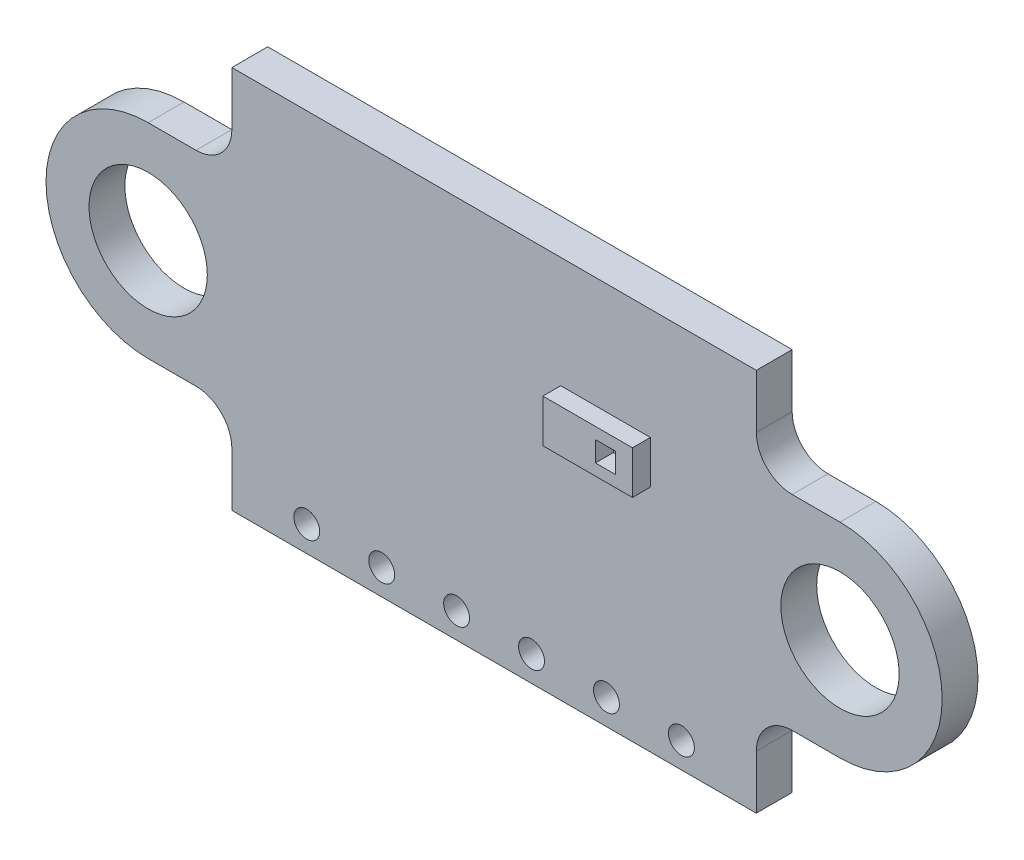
ISO-10303-21;
HEADER;
FILE_DESCRIPTION(('STEP AP214'),'2;1');
FILE_NAME('part.step','',(''),(''),'','','');
FILE_SCHEMA(('AUTOMOTIVE_DESIGN { 1 0 10303 214 1 1 1 1 }'));
ENDSEC;
DATA;
#1=APPLICATION_CONTEXT('core data for automotive mechanical design processes');
#2=APPLICATION_PROTOCOL_DEFINITION('international standard','automotive_design',2000,#1);
#3=PRODUCT_CONTEXT('',#1,'mechanical');
#4=PRODUCT('Part','Part','',(#3));
#5=PRODUCT_RELATED_PRODUCT_CATEGORY('part','',(#4));
#6=PRODUCT_DEFINITION_FORMATION('','',#4);
#7=PRODUCT_DEFINITION_CONTEXT('part definition',#1,'design');
#8=PRODUCT_DEFINITION('design','',#6,#7);
#9=PRODUCT_DEFINITION_SHAPE('','',#8);
#10=(LENGTH_UNIT() NAMED_UNIT(*) SI_UNIT(.MILLI.,.METRE.));
#11=(NAMED_UNIT(*) PLANE_ANGLE_UNIT() SI_UNIT($,.RADIAN.));
#12=(NAMED_UNIT(*) SI_UNIT($,.STERADIAN.) SOLID_ANGLE_UNIT());
#13=UNCERTAINTY_MEASURE_WITH_UNIT(LENGTH_MEASURE(1.E-05),#10,'distance_accuracy_value','');
#14=(GEOMETRIC_REPRESENTATION_CONTEXT(3) GLOBAL_UNCERTAINTY_ASSIGNED_CONTEXT((#13)) GLOBAL_UNIT_ASSIGNED_CONTEXT((#10,
#11,#12)) REPRESENTATION_CONTEXT('',''));
#15=CARTESIAN_POINT('',(0.,0.,0.));
#16=DIRECTION('',(0.,0.,1.));
#17=DIRECTION('',(1.,0.,0.));
#18=AXIS2_PLACEMENT_3D('',#15,#16,#17);
#19=CARTESIAN_POINT('',(-8.31558773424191,-3.85,0.999999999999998));
#20=DIRECTION('',(0.,0.,-1.));
#21=DIRECTION('',(-1.,0.,0.));
#22=AXIS2_PLACEMENT_3D('',#19,#20,#21);
#23=PLANE('',#22);
#24=DIRECTION('',(0.,1.,0.));
#25=VECTOR('',#24,1.);
#26=CARTESIAN_POINT('',(7.31558773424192,-3.85,0.999999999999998));
#27=LINE('',#26,#25);
#28=CARTESIAN_POINT('',(7.31558773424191,-5.35,0.999999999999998));
#29=VERTEX_POINT('',#28);
#30=CARTESIAN_POINT('',(7.31558773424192,-3.85,0.999999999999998));
#31=VERTEX_POINT('',#30);
#32=EDGE_CURVE('E319',#29,#31,#27,.T.);
#33=ORIENTED_EDGE('',*,*,#32,.T.);
#34=CARTESIAN_POINT('',(8.31558773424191,-3.85,0.999999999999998));
#35=DIRECTION('',(0.,0.,-1.));
#36=DIRECTION('',(1.,0.,0.));
#37=AXIS2_PLACEMENT_3D('',#34,#35,#36);
#38=CIRCLE('',#37,1.);
#39=CARTESIAN_POINT('',(8.31558773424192,-2.85,0.999999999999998));
#40=VERTEX_POINT('',#39);
#41=EDGE_CURVE('E322',#31,#40,#38,.T.);
#42=ORIENTED_EDGE('',*,*,#41,.T.);
#43=DIRECTION('',(1.,0.,0.));
#44=VECTOR('',#43,1.);
#45=CARTESIAN_POINT('',(9.65,-2.85,0.999999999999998));
#46=LINE('',#45,#44);
#47=CARTESIAN_POINT('',(9.65,-2.85,0.999999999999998));
#48=VERTEX_POINT('',#47);
#49=EDGE_CURVE('E325',#40,#48,#46,.T.);
#50=ORIENTED_EDGE('',*,*,#49,.T.);
#51=CARTESIAN_POINT('',(9.65,0.,0.999999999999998));
#52=DIRECTION('',(0.,0.,1.));
#53=DIRECTION('',(-1.,0.,0.));
#54=AXIS2_PLACEMENT_3D('',#51,#52,#53);
#55=CIRCLE('',#54,2.85);
#56=CARTESIAN_POINT('',(9.65,2.85,0.999999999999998));
#57=VERTEX_POINT('',#56);
#58=EDGE_CURVE('E327',#48,#57,#55,.T.);
#59=ORIENTED_EDGE('',*,*,#58,.T.);
#60=DIRECTION('',(-1.,0.,0.));
#61=VECTOR('',#60,1.);
#62=CARTESIAN_POINT('',(9.65,2.85,0.999999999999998));
#63=LINE('',#62,#61);
#64=CARTESIAN_POINT('',(8.31558773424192,2.85,0.999999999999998));
#65=VERTEX_POINT('',#64);
#66=EDGE_CURVE('E329',#57,#65,#63,.T.);
#67=ORIENTED_EDGE('',*,*,#66,.T.);
#68=CARTESIAN_POINT('',(8.31558773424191,3.85,0.999999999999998));
#69=DIRECTION('',(0.,0.,-1.));
#70=DIRECTION('',(-1.,0.,0.));
#71=AXIS2_PLACEMENT_3D('',#68,#69,#70);
#72=CIRCLE('',#71,0.999999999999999);
#73=CARTESIAN_POINT('',(7.31558773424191,3.85,0.999999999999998));
#74=VERTEX_POINT('',#73);
#75=EDGE_CURVE('E331',#65,#74,#72,.T.);
#76=ORIENTED_EDGE('',*,*,#75,.T.);
#77=DIRECTION('',(0.,1.,0.));
#78=VECTOR('',#77,1.);
#79=CARTESIAN_POINT('',(7.31558773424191,5.35,0.999999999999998));
#80=LINE('',#79,#78);
#81=CARTESIAN_POINT('',(7.31558773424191,5.35,0.999999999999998));
#82=VERTEX_POINT('',#81);
#83=EDGE_CURVE('E333',#74,#82,#80,.T.);
#84=ORIENTED_EDGE('',*,*,#83,.T.);
#85=DIRECTION('',(-1.,0.,0.));
#86=VECTOR('',#85,1.);
#87=CARTESIAN_POINT('',(-7.31558773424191,5.35,0.999999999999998));
#88=LINE('',#87,#86);
#89=CARTESIAN_POINT('',(-7.31558773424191,5.35,0.999999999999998));
#90=VERTEX_POINT('',#89);
#91=EDGE_CURVE('E335',#82,#90,#88,.T.);
#92=ORIENTED_EDGE('',*,*,#91,.T.);
#93=DIRECTION('',(0.,-1.,0.));
#94=VECTOR('',#93,1.);
#95=CARTESIAN_POINT('',(-7.31558773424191,5.35,0.999999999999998));
#96=LINE('',#95,#94);
#97=CARTESIAN_POINT('',(-7.31558773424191,3.84999999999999,0.999999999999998));
#98=VERTEX_POINT('',#97);
#99=EDGE_CURVE('E337',#90,#98,#96,.T.);
#100=ORIENTED_EDGE('',*,*,#99,.T.);
#101=CARTESIAN_POINT('',(-8.31558773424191,3.84999999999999,0.999999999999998));
#102=DIRECTION('',(0.,0.,-1.));
#103=DIRECTION('',(1.,0.,0.));
#104=AXIS2_PLACEMENT_3D('',#101,#102,#103);
#105=CIRCLE('',#104,1.);
#106=CARTESIAN_POINT('',(-8.31558773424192,2.85,0.999999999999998));
#107=VERTEX_POINT('',#106);
#108=EDGE_CURVE('E339',#98,#107,#105,.T.);
#109=ORIENTED_EDGE('',*,*,#108,.T.);
#110=DIRECTION('',(-1.,0.,0.));
#111=VECTOR('',#110,1.);
#112=CARTESIAN_POINT('',(-9.65,2.85,0.999999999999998));
#113=LINE('',#112,#111);
#114=CARTESIAN_POINT('',(-9.65,2.85,0.999999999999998));
#115=VERTEX_POINT('',#114);
#116=EDGE_CURVE('E341',#107,#115,#113,.T.);
#117=ORIENTED_EDGE('',*,*,#116,.T.);
#118=CARTESIAN_POINT('',(-9.65,0.,0.999999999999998));
#119=DIRECTION('',(0.,0.,1.));
#120=DIRECTION('',(1.,0.,0.));
#121=AXIS2_PLACEMENT_3D('',#118,#119,#120);
#122=CIRCLE('',#121,2.85);
#123=CARTESIAN_POINT('',(-9.65,-2.85,0.999999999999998));
#124=VERTEX_POINT('',#123);
#125=EDGE_CURVE('E343',#115,#124,#122,.T.);
#126=ORIENTED_EDGE('',*,*,#125,.T.);
#127=DIRECTION('',(1.,0.,0.));
#128=VECTOR('',#127,1.);
#129=CARTESIAN_POINT('',(-9.65,-2.85,0.999999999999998));
#130=LINE('',#129,#128);
#131=CARTESIAN_POINT('',(-8.31558773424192,-2.85,0.999999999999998));
#132=VERTEX_POINT('',#131);
#133=EDGE_CURVE('E345',#124,#132,#130,.T.);
#134=ORIENTED_EDGE('',*,*,#133,.T.);
#135=CARTESIAN_POINT('',(-8.31558773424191,-3.85,0.999999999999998));
#136=DIRECTION('',(0.,0.,-1.));
#137=DIRECTION('',(-1.,0.,0.));
#138=AXIS2_PLACEMENT_3D('',#135,#136,#137);
#139=CIRCLE('',#138,1.);
#140=CARTESIAN_POINT('',(-7.31558773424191,-3.85000000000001,0.999999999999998));
#141=VERTEX_POINT('',#140);
#142=EDGE_CURVE('E347',#132,#141,#139,.T.);
#143=ORIENTED_EDGE('',*,*,#142,.T.);
#144=DIRECTION('',(0.,-1.,0.));
#145=VECTOR('',#144,1.);
#146=CARTESIAN_POINT('',(-7.31558773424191,-3.85000000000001,0.999999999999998));
#147=LINE('',#146,#145);
#148=CARTESIAN_POINT('',(-7.31558773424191,-5.35,0.999999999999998));
#149=VERTEX_POINT('',#148);
#150=EDGE_CURVE('E349',#141,#149,#147,.T.);
#151=ORIENTED_EDGE('',*,*,#150,.T.);
#152=DIRECTION('',(1.,0.,0.));
#153=VECTOR('',#152,1.);
#154=CARTESIAN_POINT('',(-7.31558773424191,-5.35,0.999999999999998));
#155=LINE('',#154,#153);
#156=EDGE_CURVE('E351',#149,#29,#155,.T.);
#157=ORIENTED_EDGE('',*,*,#156,.T.);
#158=EDGE_LOOP('',(#33,#42,#50,#59,#67,#76,#84,#92,#100,#109,#117,#126,#134,#143,#151,#157));
#159=FACE_BOUND('',#158,.T.);
#160=CARTESIAN_POINT('',(-9.65,0.,0.999999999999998));
#161=DIRECTION('',(0.,0.,1.));
#162=DIRECTION('',(1.,0.,0.));
#163=AXIS2_PLACEMENT_3D('',#160,#161,#162);
#164=CIRCLE('',#163,1.65);
#165=CARTESIAN_POINT('',(-8.,0.,0.999999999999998));
#166=VERTEX_POINT('',#165);
#167=EDGE_CURVE('E313',#166,#166,#164,.T.);
#168=ORIENTED_EDGE('',*,*,#167,.F.);
#169=EDGE_LOOP('',(#168));
#170=FACE_BOUND('',#169,.T.);
#171=CARTESIAN_POINT('',(9.65,0.,0.999999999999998));
#172=DIRECTION('',(0.,0.,1.));
#173=DIRECTION('',(-1.,0.,0.));
#174=AXIS2_PLACEMENT_3D('',#171,#172,#173);
#175=CIRCLE('',#174,1.65);
#176=CARTESIAN_POINT('',(8.,0.,0.999999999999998));
#177=VERTEX_POINT('',#176);
#178=EDGE_CURVE('E307',#177,#177,#175,.T.);
#179=ORIENTED_EDGE('',*,*,#178,.F.);
#180=EDGE_LOOP('',(#179));
#181=FACE_BOUND('',#180,.T.);
#182=CARTESIAN_POINT('',(-5.22541981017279,-4.63777756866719,0.999999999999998));
#183=DIRECTION('',(0.,0.,1.));
#184=DIRECTION('',(1.,0.,0.));
#185=AXIS2_PLACEMENT_3D('',#182,#183,#184);
#186=CIRCLE('',#185,0.3614638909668);
#187=CARTESIAN_POINT('',(-4.86395591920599,-4.63777756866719,0.999999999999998));
#188=VERTEX_POINT('',#187);
#189=EDGE_CURVE('E301',#188,#188,#186,.T.);
#190=ORIENTED_EDGE('',*,*,#189,.F.);
#191=EDGE_LOOP('',(#190));
#192=FACE_BOUND('',#191,.T.);
#193=CARTESIAN_POINT('',(-3.13525188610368,-4.63777756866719,0.999999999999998));
#194=DIRECTION('',(0.,0.,1.));
#195=DIRECTION('',(1.,0.,0.));
#196=AXIS2_PLACEMENT_3D('',#193,#194,#195);
#197=CIRCLE('',#196,0.3614638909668);
#198=CARTESIAN_POINT('',(-2.77378799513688,-4.63777756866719,0.999999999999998));
#199=VERTEX_POINT('',#198);
#200=EDGE_CURVE('E295',#199,#199,#197,.T.);
#201=ORIENTED_EDGE('',*,*,#200,.F.);
#202=EDGE_LOOP('',(#201));
#203=FACE_BOUND('',#202,.T.);
#204=CARTESIAN_POINT('',(-1.04508396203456,-4.63777756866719,0.999999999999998));
#205=DIRECTION('',(0.,0.,1.));
#206=DIRECTION('',(1.,0.,0.));
#207=AXIS2_PLACEMENT_3D('',#204,#205,#206);
#208=CIRCLE('',#207,0.3614638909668);
#209=CARTESIAN_POINT('',(-0.683620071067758,-4.63777756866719,0.999999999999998));
#210=VERTEX_POINT('',#209);
#211=EDGE_CURVE('E289',#210,#210,#208,.T.);
#212=ORIENTED_EDGE('',*,*,#211,.F.);
#213=EDGE_LOOP('',(#212));
#214=FACE_BOUND('',#213,.T.);
#215=CARTESIAN_POINT('',(1.04508396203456,-4.63777756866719,0.999999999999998));
#216=DIRECTION('',(0.,0.,1.));
#217=DIRECTION('',(-1.,0.,0.));
#218=AXIS2_PLACEMENT_3D('',#215,#216,#217);
#219=CIRCLE('',#218,0.3614638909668);
#220=CARTESIAN_POINT('',(0.68362007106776,-4.63777756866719,0.999999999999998));
#221=VERTEX_POINT('',#220);
#222=EDGE_CURVE('E283',#221,#221,#219,.T.);
#223=ORIENTED_EDGE('',*,*,#222,.F.);
#224=EDGE_LOOP('',(#223));
#225=FACE_BOUND('',#224,.T.);
#226=CARTESIAN_POINT('',(3.13525188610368,-4.63777756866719,0.999999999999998));
#227=DIRECTION('',(0.,0.,1.));
#228=DIRECTION('',(-1.,0.,0.));
#229=AXIS2_PLACEMENT_3D('',#226,#227,#228);
#230=CIRCLE('',#229,0.3614638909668);
#231=CARTESIAN_POINT('',(2.77378799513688,-4.63777756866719,0.999999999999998));
#232=VERTEX_POINT('',#231);
#233=EDGE_CURVE('E277',#232,#232,#230,.T.);
#234=ORIENTED_EDGE('',*,*,#233,.F.);
#235=EDGE_LOOP('',(#234));
#236=FACE_BOUND('',#235,.T.);
#237=CARTESIAN_POINT('',(5.2254198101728,-4.63777756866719,0.999999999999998));
#238=DIRECTION('',(0.,0.,1.));
#239=DIRECTION('',(-1.,0.,0.));
#240=AXIS2_PLACEMENT_3D('',#237,#238,#239);
#241=CIRCLE('',#240,0.3614638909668);
#242=CARTESIAN_POINT('',(4.863955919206,-4.63777756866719,0.999999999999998));
#243=VERTEX_POINT('',#242);
#244=EDGE_CURVE('E271',#243,#243,#241,.T.);
#245=ORIENTED_EDGE('',*,*,#244,.F.);
#246=EDGE_LOOP('',(#245));
#247=FACE_BOUND('',#246,.T.);
#248=DIRECTION('',(0.,1.,0.));
#249=VECTOR('',#248,1.);
#250=CARTESIAN_POINT('',(4.36,2.25023521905,0.999999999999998));
#251=LINE('',#250,#249);
#252=CARTESIAN_POINT('',(4.36,1.04976478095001,0.999999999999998));
#253=VERTEX_POINT('',#252);
#254=CARTESIAN_POINT('',(4.36,2.25023521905,0.999999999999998));
#255=VERTEX_POINT('',#254);
#256=EDGE_CURVE('E219',#253,#255,#251,.T.);
#257=ORIENTED_EDGE('',*,*,#256,.F.);
#258=DIRECTION('',(1.,0.,0.));
#259=VECTOR('',#258,1.);
#260=CARTESIAN_POINT('',(1.86,1.04976478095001,0.999999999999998));
#261=LINE('',#260,#259);
#262=CARTESIAN_POINT('',(1.86,1.04976478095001,0.999999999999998));
#263=VERTEX_POINT('',#262);
#264=EDGE_CURVE('E247',#263,#253,#261,.T.);
#265=ORIENTED_EDGE('',*,*,#264,.F.);
#266=DIRECTION('',(0.,-1.,0.));
#267=VECTOR('',#266,1.);
#268=CARTESIAN_POINT('',(1.86,2.25023521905,0.999999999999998));
#269=LINE('',#268,#267);
#270=CARTESIAN_POINT('',(1.86,2.25023521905,0.999999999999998));
#271=VERTEX_POINT('',#270);
#272=EDGE_CURVE('E61',#271,#263,#269,.T.);
#273=ORIENTED_EDGE('',*,*,#272,.F.);
#274=DIRECTION('',(-1.,0.,0.));
#275=VECTOR('',#274,1.);
#276=CARTESIAN_POINT('',(1.86,2.25023521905,0.999999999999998));
#277=LINE('',#276,#275);
#278=EDGE_CURVE('E56',#255,#271,#277,.T.);
#279=ORIENTED_EDGE('',*,*,#278,.F.);
#280=EDGE_LOOP('',(#257,#265,#273,#279));
#281=FACE_BOUND('',#280,.T.);
#282=ADVANCED_FACE('F41',(#159,#170,#181,#192,#203,#214,#225,#236,#247,#281),#23,.F.);
#283=CARTESIAN_POINT('',(-8.31558773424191,-3.85,0.));
#284=DIRECTION('',(0.,0.,-1.));
#285=DIRECTION('',(-1.,0.,0.));
#286=AXIS2_PLACEMENT_3D('',#283,#284,#285);
#287=PLANE('',#286);
#288=CARTESIAN_POINT('',(3.13525188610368,-4.63777756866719,0.));
#289=DIRECTION('',(0.,0.,1.));
#290=DIRECTION('',(-1.,0.,0.));
#291=AXIS2_PLACEMENT_3D('',#288,#289,#290);
#292=CIRCLE('',#291,0.3614638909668);
#293=CARTESIAN_POINT('',(2.77378799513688,-4.63777756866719,0.));
#294=VERTEX_POINT('',#293);
#295=EDGE_CURVE('E274',#294,#294,#292,.T.);
#296=ORIENTED_EDGE('',*,*,#295,.T.);
#297=EDGE_LOOP('',(#296));
#298=FACE_BOUND('',#297,.T.);
#299=CARTESIAN_POINT('',(-1.04508396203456,-4.63777756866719,0.));
#300=DIRECTION('',(0.,0.,1.));
#301=DIRECTION('',(1.,0.,0.));
#302=AXIS2_PLACEMENT_3D('',#299,#300,#301);
#303=CIRCLE('',#302,0.3614638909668);
#304=CARTESIAN_POINT('',(-0.683620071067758,-4.63777756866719,0.));
#305=VERTEX_POINT('',#304);
#306=EDGE_CURVE('E286',#305,#305,#303,.T.);
#307=ORIENTED_EDGE('',*,*,#306,.T.);
#308=EDGE_LOOP('',(#307));
#309=FACE_BOUND('',#308,.T.);
#310=CARTESIAN_POINT('',(-5.22541981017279,-4.63777756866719,0.));
#311=DIRECTION('',(0.,0.,1.));
#312=DIRECTION('',(1.,0.,0.));
#313=AXIS2_PLACEMENT_3D('',#310,#311,#312);
#314=CIRCLE('',#313,0.3614638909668);
#315=CARTESIAN_POINT('',(-4.86395591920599,-4.63777756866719,0.));
#316=VERTEX_POINT('',#315);
#317=EDGE_CURVE('E298',#316,#316,#314,.T.);
#318=ORIENTED_EDGE('',*,*,#317,.T.);
#319=EDGE_LOOP('',(#318));
#320=FACE_BOUND('',#319,.T.);
#321=CARTESIAN_POINT('',(-9.65,0.,0.));
#322=DIRECTION('',(0.,0.,1.));
#323=DIRECTION('',(1.,0.,0.));
#324=AXIS2_PLACEMENT_3D('',#321,#322,#323);
#325=CIRCLE('',#324,1.65);
#326=CARTESIAN_POINT('',(-8.,0.,0.));
#327=VERTEX_POINT('',#326);
#328=EDGE_CURVE('E310',#327,#327,#325,.T.);
#329=ORIENTED_EDGE('',*,*,#328,.T.);
#330=EDGE_LOOP('',(#329));
#331=FACE_BOUND('',#330,.T.);
#332=DIRECTION('',(0.,1.,0.));
#333=VECTOR('',#332,1.);
#334=CARTESIAN_POINT('',(7.31558773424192,-3.85,0.));
#335=LINE('',#334,#333);
#336=CARTESIAN_POINT('',(7.31558773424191,-5.35,0.));
#337=VERTEX_POINT('',#336);
#338=CARTESIAN_POINT('',(7.31558773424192,-3.85,0.));
#339=VERTEX_POINT('',#338);
#340=EDGE_CURVE('E316',#337,#339,#335,.T.);
#341=ORIENTED_EDGE('',*,*,#340,.F.);
#342=DIRECTION('',(1.,0.,0.));
#343=VECTOR('',#342,1.);
#344=CARTESIAN_POINT('',(-7.31558773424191,-5.35,0.));
#345=LINE('',#344,#343);
#346=CARTESIAN_POINT('',(-7.31558773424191,-5.35,0.));
#347=VERTEX_POINT('',#346);
#348=EDGE_CURVE('E323',#347,#337,#345,.T.);
#349=ORIENTED_EDGE('',*,*,#348,.F.);
#350=DIRECTION('',(0.,-1.,0.));
#351=VECTOR('',#350,1.);
#352=CARTESIAN_POINT('',(-7.31558773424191,-3.85000000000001,0.));
#353=LINE('',#352,#351);
#354=CARTESIAN_POINT('',(-7.31558773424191,-3.85000000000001,0.));
#355=VERTEX_POINT('',#354);
#356=EDGE_CURVE('E382',#355,#347,#353,.T.);
#357=ORIENTED_EDGE('',*,*,#356,.F.);
#358=CARTESIAN_POINT('',(-8.31558773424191,-3.85,0.));
#359=DIRECTION('',(0.,0.,-1.));
#360=DIRECTION('',(-1.,0.,0.));
#361=AXIS2_PLACEMENT_3D('',#358,#359,#360);
#362=CIRCLE('',#361,1.);
#363=CARTESIAN_POINT('',(-8.31558773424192,-2.85,0.));
#364=VERTEX_POINT('',#363);
#365=EDGE_CURVE('E380',#364,#355,#362,.T.);
#366=ORIENTED_EDGE('',*,*,#365,.F.);
#367=DIRECTION('',(1.,0.,0.));
#368=VECTOR('',#367,1.);
#369=CARTESIAN_POINT('',(-9.65,-2.85,0.));
#370=LINE('',#369,#368);
#371=CARTESIAN_POINT('',(-9.65,-2.85,0.));
#372=VERTEX_POINT('',#371);
#373=EDGE_CURVE('E378',#372,#364,#370,.T.);
#374=ORIENTED_EDGE('',*,*,#373,.F.);
#375=CARTESIAN_POINT('',(-9.65,0.,0.));
#376=DIRECTION('',(0.,0.,1.));
#377=DIRECTION('',(1.,0.,0.));
#378=AXIS2_PLACEMENT_3D('',#375,#376,#377);
#379=CIRCLE('',#378,2.85);
#380=CARTESIAN_POINT('',(-9.65,2.85,0.));
#381=VERTEX_POINT('',#380);
#382=EDGE_CURVE('E376',#381,#372,#379,.T.);
#383=ORIENTED_EDGE('',*,*,#382,.F.);
#384=DIRECTION('',(-1.,0.,0.));
#385=VECTOR('',#384,1.);
#386=CARTESIAN_POINT('',(-9.65,2.85,0.));
#387=LINE('',#386,#385);
#388=CARTESIAN_POINT('',(-8.31558773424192,2.85,0.));
#389=VERTEX_POINT('',#388);
#390=EDGE_CURVE('E374',#389,#381,#387,.T.);
#391=ORIENTED_EDGE('',*,*,#390,.F.);
#392=CARTESIAN_POINT('',(-8.31558773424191,3.84999999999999,0.));
#393=DIRECTION('',(0.,0.,-1.));
#394=DIRECTION('',(1.,0.,0.));
#395=AXIS2_PLACEMENT_3D('',#392,#393,#394);
#396=CIRCLE('',#395,1.);
#397=CARTESIAN_POINT('',(-7.31558773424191,3.84999999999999,0.));
#398=VERTEX_POINT('',#397);
#399=EDGE_CURVE('E372',#398,#389,#396,.T.);
#400=ORIENTED_EDGE('',*,*,#399,.F.);
#401=DIRECTION('',(0.,-1.,0.));
#402=VECTOR('',#401,1.);
#403=CARTESIAN_POINT('',(-7.31558773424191,5.35,0.));
#404=LINE('',#403,#402);
#405=CARTESIAN_POINT('',(-7.31558773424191,5.35,0.));
#406=VERTEX_POINT('',#405);
#407=EDGE_CURVE('E370',#406,#398,#404,.T.);
#408=ORIENTED_EDGE('',*,*,#407,.F.);
#409=DIRECTION('',(-1.,0.,0.));
#410=VECTOR('',#409,1.);
#411=CARTESIAN_POINT('',(-7.31558773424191,5.35,0.));
#412=LINE('',#411,#410);
#413=CARTESIAN_POINT('',(7.31558773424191,5.35,0.));
#414=VERTEX_POINT('',#413);
#415=EDGE_CURVE('E368',#414,#406,#412,.T.);
#416=ORIENTED_EDGE('',*,*,#415,.F.);
#417=DIRECTION('',(0.,1.,0.));
#418=VECTOR('',#417,1.);
#419=CARTESIAN_POINT('',(7.31558773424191,5.35,0.));
#420=LINE('',#419,#418);
#421=CARTESIAN_POINT('',(7.31558773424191,3.85,0.));
#422=VERTEX_POINT('',#421);
#423=EDGE_CURVE('E366',#422,#414,#420,.T.);
#424=ORIENTED_EDGE('',*,*,#423,.F.);
#425=CARTESIAN_POINT('',(8.31558773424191,3.85,0.));
#426=DIRECTION('',(0.,0.,-1.));
#427=DIRECTION('',(-1.,0.,0.));
#428=AXIS2_PLACEMENT_3D('',#425,#426,#427);
#429=CIRCLE('',#428,0.999999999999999);
#430=CARTESIAN_POINT('',(8.31558773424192,2.85,0.));
#431=VERTEX_POINT('',#430);
#432=EDGE_CURVE('E364',#431,#422,#429,.T.);
#433=ORIENTED_EDGE('',*,*,#432,.F.);
#434=DIRECTION('',(-1.,0.,0.));
#435=VECTOR('',#434,1.);
#436=CARTESIAN_POINT('',(9.65,2.85,0.));
#437=LINE('',#436,#435);
#438=CARTESIAN_POINT('',(9.65,2.85,0.));
#439=VERTEX_POINT('',#438);
#440=EDGE_CURVE('E362',#439,#431,#437,.T.);
#441=ORIENTED_EDGE('',*,*,#440,.F.);
#442=CARTESIAN_POINT('',(9.65,0.,0.));
#443=DIRECTION('',(0.,0.,1.));
#444=DIRECTION('',(-1.,0.,0.));
#445=AXIS2_PLACEMENT_3D('',#442,#443,#444);
#446=CIRCLE('',#445,2.85);
#447=CARTESIAN_POINT('',(9.65,-2.85,0.));
#448=VERTEX_POINT('',#447);
#449=EDGE_CURVE('E360',#448,#439,#446,.T.);
#450=ORIENTED_EDGE('',*,*,#449,.F.);
#451=DIRECTION('',(1.,0.,0.));
#452=VECTOR('',#451,1.);
#453=CARTESIAN_POINT('',(9.65,-2.85,0.));
#454=LINE('',#453,#452);
#455=CARTESIAN_POINT('',(8.31558773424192,-2.85,0.));
#456=VERTEX_POINT('',#455);
#457=EDGE_CURVE('E358',#456,#448,#454,.T.);
#458=ORIENTED_EDGE('',*,*,#457,.F.);
#459=CARTESIAN_POINT('',(8.31558773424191,-3.85,0.));
#460=DIRECTION('',(0.,0.,-1.));
#461=DIRECTION('',(1.,0.,0.));
#462=AXIS2_PLACEMENT_3D('',#459,#460,#461);
#463=CIRCLE('',#462,1.);
#464=EDGE_CURVE('E356',#339,#456,#463,.T.);
#465=ORIENTED_EDGE('',*,*,#464,.F.);
#466=EDGE_LOOP('',(#341,#349,#357,#366,#374,#383,#391,#400,#408,#416,#424,#433,#441,#450,#458,#465));
#467=FACE_BOUND('',#466,.T.);
#468=CARTESIAN_POINT('',(9.65,0.,0.));
#469=DIRECTION('',(0.,0.,1.));
#470=DIRECTION('',(-1.,0.,0.));
#471=AXIS2_PLACEMENT_3D('',#468,#469,#470);
#472=CIRCLE('',#471,1.65);
#473=CARTESIAN_POINT('',(8.,0.,0.));
#474=VERTEX_POINT('',#473);
#475=EDGE_CURVE('E304',#474,#474,#472,.T.);
#476=ORIENTED_EDGE('',*,*,#475,.T.);
#477=EDGE_LOOP('',(#476));
#478=FACE_BOUND('',#477,.T.);
#479=CARTESIAN_POINT('',(-3.13525188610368,-4.63777756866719,0.));
#480=DIRECTION('',(0.,0.,1.));
#481=DIRECTION('',(1.,0.,0.));
#482=AXIS2_PLACEMENT_3D('',#479,#480,#481);
#483=CIRCLE('',#482,0.3614638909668);
#484=CARTESIAN_POINT('',(-2.77378799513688,-4.63777756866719,0.));
#485=VERTEX_POINT('',#484);
#486=EDGE_CURVE('E292',#485,#485,#483,.T.);
#487=ORIENTED_EDGE('',*,*,#486,.T.);
#488=EDGE_LOOP('',(#487));
#489=FACE_BOUND('',#488,.T.);
#490=CARTESIAN_POINT('',(1.04508396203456,-4.63777756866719,0.));
#491=DIRECTION('',(0.,0.,1.));
#492=DIRECTION('',(-1.,0.,0.));
#493=AXIS2_PLACEMENT_3D('',#490,#491,#492);
#494=CIRCLE('',#493,0.3614638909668);
#495=CARTESIAN_POINT('',(0.68362007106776,-4.63777756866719,0.));
#496=VERTEX_POINT('',#495);
#497=EDGE_CURVE('E280',#496,#496,#494,.T.);
#498=ORIENTED_EDGE('',*,*,#497,.T.);
#499=EDGE_LOOP('',(#498));
#500=FACE_BOUND('',#499,.T.);
#501=CARTESIAN_POINT('',(5.2254198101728,-4.63777756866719,0.));
#502=DIRECTION('',(0.,0.,1.));
#503=DIRECTION('',(-1.,0.,0.));
#504=AXIS2_PLACEMENT_3D('',#501,#502,#503);
#505=CIRCLE('',#504,0.3614638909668);
#506=CARTESIAN_POINT('',(4.863955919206,-4.63777756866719,0.));
#507=VERTEX_POINT('',#506);
#508=EDGE_CURVE('E270',#507,#507,#505,.T.);
#509=ORIENTED_EDGE('',*,*,#508,.T.);
#510=EDGE_LOOP('',(#509));
#511=FACE_BOUND('',#510,.T.);
#512=ADVANCED_FACE('F436',(#298,#309,#320,#331,#467,#478,#489,#500,#511),#287,.T.);
#513=CARTESIAN_POINT('',(7.31558773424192,-3.85,0.999999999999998));
#514=DIRECTION('',(-1.,0.,0.));
#515=DIRECTION('',(0.,-1.,0.));
#516=AXIS2_PLACEMENT_3D('',#513,#514,#515);
#517=PLANE('',#516);
#518=ORIENTED_EDGE('',*,*,#340,.T.);
#519=DIRECTION('',(0.,0.,-1.));
#520=VECTOR('',#519,1.);
#521=CARTESIAN_POINT('',(7.31558773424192,-3.85,0.999999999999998));
#522=LINE('',#521,#520);
#523=EDGE_CURVE('E11',#31,#339,#522,.T.);
#524=ORIENTED_EDGE('',*,*,#523,.F.);
#525=ORIENTED_EDGE('',*,*,#32,.F.);
#526=DIRECTION('',(0.,0.,-1.));
#527=VECTOR('',#526,1.);
#528=CARTESIAN_POINT('',(7.31558773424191,-5.35,0.999999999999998));
#529=LINE('',#528,#527);
#530=EDGE_CURVE('E353',#29,#337,#529,.T.);
#531=ORIENTED_EDGE('',*,*,#530,.T.);
#532=EDGE_LOOP('',(#518,#524,#525,#531));
#533=FACE_BOUND('',#532,.T.);
#534=ADVANCED_FACE('F43',(#533),#517,.F.);
#535=CARTESIAN_POINT('',(8.31558773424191,-3.85,0.999999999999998));
#536=DIRECTION('',(0.,0.,-1.));
#537=DIRECTION('',(-1.,0.,0.));
#538=AXIS2_PLACEMENT_3D('',#535,#536,#537);
#539=CYLINDRICAL_SURFACE('',#538,1.);
#540=ORIENTED_EDGE('',*,*,#464,.T.);
#541=DIRECTION('',(0.,0.,-1.));
#542=VECTOR('',#541,1.);
#543=CARTESIAN_POINT('',(8.31558773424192,-2.85,0.999999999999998));
#544=LINE('',#543,#542);
#545=EDGE_CURVE('E49',#40,#456,#544,.T.);
#546=ORIENTED_EDGE('',*,*,#545,.F.);
#547=ORIENTED_EDGE('',*,*,#41,.F.);
#548=ORIENTED_EDGE('',*,*,#523,.T.);
#549=EDGE_LOOP('',(#540,#546,#547,#548));
#550=FACE_BOUND('',#549,.T.);
#551=ADVANCED_FACE('F454',(#550),#539,.F.);
#552=CARTESIAN_POINT('',(9.65,-2.85,0.999999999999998));
#553=DIRECTION('',(0.,1.,0.));
#554=DIRECTION('',(-1.,0.,0.));
#555=AXIS2_PLACEMENT_3D('',#552,#553,#554);
#556=PLANE('',#555);
#557=ORIENTED_EDGE('',*,*,#457,.T.);
#558=DIRECTION('',(0.,0.,-1.));
#559=VECTOR('',#558,1.);
#560=CARTESIAN_POINT('',(9.65,-2.85,0.999999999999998));
#561=LINE('',#560,#559);
#562=EDGE_CURVE('E423',#48,#448,#561,.T.);
#563=ORIENTED_EDGE('',*,*,#562,.F.);
#564=ORIENTED_EDGE('',*,*,#49,.F.);
#565=ORIENTED_EDGE('',*,*,#545,.T.);
#566=EDGE_LOOP('',(#557,#563,#564,#565));
#567=FACE_BOUND('',#566,.T.);
#568=ADVANCED_FACE('F430',(#567),#556,.F.);
#569=CARTESIAN_POINT('',(9.65,0.,0.999999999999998));
#570=DIRECTION('',(0.,0.,-1.));
#571=DIRECTION('',(-1.,0.,0.));
#572=AXIS2_PLACEMENT_3D('',#569,#570,#571);
#573=CYLINDRICAL_SURFACE('',#572,2.85);
#574=ORIENTED_EDGE('',*,*,#449,.T.);
#575=DIRECTION('',(0.,0.,-1.));
#576=VECTOR('',#575,1.);
#577=CARTESIAN_POINT('',(9.65,2.85,0.999999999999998));
#578=LINE('',#577,#576);
#579=EDGE_CURVE('E420',#57,#439,#578,.T.);
#580=ORIENTED_EDGE('',*,*,#579,.F.);
#581=ORIENTED_EDGE('',*,*,#58,.F.);
#582=ORIENTED_EDGE('',*,*,#562,.T.);
#583=EDGE_LOOP('',(#574,#580,#581,#582));
#584=FACE_BOUND('',#583,.T.);
#585=ADVANCED_FACE('F442',(#584),#573,.T.);
#586=CARTESIAN_POINT('',(9.65,2.85,0.999999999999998));
#587=DIRECTION('',(0.,-1.,0.));
#588=DIRECTION('',(1.,0.,0.));
#589=AXIS2_PLACEMENT_3D('',#586,#587,#588);
#590=PLANE('',#589);
#591=ORIENTED_EDGE('',*,*,#440,.T.);
#592=DIRECTION('',(0.,0.,-1.));
#593=VECTOR('',#592,1.);
#594=CARTESIAN_POINT('',(8.31558773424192,2.85,0.999999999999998));
#595=LINE('',#594,#593);
#596=EDGE_CURVE('E417',#65,#431,#595,.T.);
#597=ORIENTED_EDGE('',*,*,#596,.F.);
#598=ORIENTED_EDGE('',*,*,#66,.F.);
#599=ORIENTED_EDGE('',*,*,#579,.T.);
#600=EDGE_LOOP('',(#591,#597,#598,#599));
#601=FACE_BOUND('',#600,.T.);
#602=ADVANCED_FACE('F446',(#601),#590,.F.);
#603=CARTESIAN_POINT('',(8.31558773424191,3.85,0.999999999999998));
#604=DIRECTION('',(0.,0.,-1.));
#605=DIRECTION('',(-1.,0.,0.));
#606=AXIS2_PLACEMENT_3D('',#603,#604,#605);
#607=CYLINDRICAL_SURFACE('',#606,0.999999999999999);
#608=ORIENTED_EDGE('',*,*,#432,.T.);
#609=DIRECTION('',(0.,0.,-1.));
#610=VECTOR('',#609,1.);
#611=CARTESIAN_POINT('',(7.31558773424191,3.85,0.999999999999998));
#612=LINE('',#611,#610);
#613=EDGE_CURVE('E414',#74,#422,#612,.T.);
#614=ORIENTED_EDGE('',*,*,#613,.F.);
#615=ORIENTED_EDGE('',*,*,#75,.F.);
#616=ORIENTED_EDGE('',*,*,#596,.T.);
#617=EDGE_LOOP('',(#608,#614,#615,#616));
#618=FACE_BOUND('',#617,.T.);
#619=ADVANCED_FACE('F507',(#618),#607,.F.);
#620=CARTESIAN_POINT('',(7.31558773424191,5.35,0.999999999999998));
#621=DIRECTION('',(-1.,0.,0.));
#622=DIRECTION('',(0.,0.,1.));
#623=AXIS2_PLACEMENT_3D('',#620,#621,#622);
#624=PLANE('',#623);
#625=ORIENTED_EDGE('',*,*,#423,.T.);
#626=DIRECTION('',(0.,0.,-1.));
#627=VECTOR('',#626,1.);
#628=CARTESIAN_POINT('',(7.31558773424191,5.35,0.999999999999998));
#629=LINE('',#628,#627);
#630=EDGE_CURVE('E411',#82,#414,#629,.T.);
#631=ORIENTED_EDGE('',*,*,#630,.F.);
#632=ORIENTED_EDGE('',*,*,#83,.F.);
#633=ORIENTED_EDGE('',*,*,#613,.T.);
#634=EDGE_LOOP('',(#625,#631,#632,#633));
#635=FACE_BOUND('',#634,.T.);
#636=ADVANCED_FACE('F504',(#635),#624,.F.);
#637=CARTESIAN_POINT('',(-7.31558773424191,5.35,0.999999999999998));
#638=DIRECTION('',(0.,-1.,0.));
#639=DIRECTION('',(1.,0.,0.));
#640=AXIS2_PLACEMENT_3D('',#637,#638,#639);
#641=PLANE('',#640);
#642=ORIENTED_EDGE('',*,*,#415,.T.);
#643=DIRECTION('',(0.,0.,-1.));
#644=VECTOR('',#643,1.);
#645=CARTESIAN_POINT('',(-7.31558773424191,5.35,0.999999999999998));
#646=LINE('',#645,#644);
#647=EDGE_CURVE('E408',#90,#406,#646,.T.);
#648=ORIENTED_EDGE('',*,*,#647,.F.);
#649=ORIENTED_EDGE('',*,*,#91,.F.);
#650=ORIENTED_EDGE('',*,*,#630,.T.);
#651=EDGE_LOOP('',(#642,#648,#649,#650));
#652=FACE_BOUND('',#651,.T.);
#653=ADVANCED_FACE('F500',(#652),#641,.F.);
#654=CARTESIAN_POINT('',(-7.31558773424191,5.35,0.999999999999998));
#655=DIRECTION('',(1.,0.,0.));
#656=DIRECTION('',(0.,1.,0.));
#657=AXIS2_PLACEMENT_3D('',#654,#655,#656);
#658=PLANE('',#657);
#659=ORIENTED_EDGE('',*,*,#407,.T.);
#660=DIRECTION('',(0.,0.,-1.));
#661=VECTOR('',#660,1.);
#662=CARTESIAN_POINT('',(-7.31558773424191,3.84999999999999,0.999999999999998));
#663=LINE('',#662,#661);
#664=EDGE_CURVE('E405',#98,#398,#663,.T.);
#665=ORIENTED_EDGE('',*,*,#664,.F.);
#666=ORIENTED_EDGE('',*,*,#99,.F.);
#667=ORIENTED_EDGE('',*,*,#647,.T.);
#668=EDGE_LOOP('',(#659,#665,#666,#667));
#669=FACE_BOUND('',#668,.T.);
#670=ADVANCED_FACE('F496',(#669),#658,.F.);
#671=CARTESIAN_POINT('',(-8.31558773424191,3.84999999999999,0.999999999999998));
#672=DIRECTION('',(0.,0.,-1.));
#673=DIRECTION('',(-1.,0.,0.));
#674=AXIS2_PLACEMENT_3D('',#671,#672,#673);
#675=CYLINDRICAL_SURFACE('',#674,1.);
#676=ORIENTED_EDGE('',*,*,#399,.T.);
#677=DIRECTION('',(0.,0.,-1.));
#678=VECTOR('',#677,1.);
#679=CARTESIAN_POINT('',(-8.31558773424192,2.85,0.999999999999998));
#680=LINE('',#679,#678);
#681=EDGE_CURVE('E402',#107,#389,#680,.T.);
#682=ORIENTED_EDGE('',*,*,#681,.F.);
#683=ORIENTED_EDGE('',*,*,#108,.F.);
#684=ORIENTED_EDGE('',*,*,#664,.T.);
#685=EDGE_LOOP('',(#676,#682,#683,#684));
#686=FACE_BOUND('',#685,.T.);
#687=ADVANCED_FACE('F491',(#686),#675,.F.);
#688=CARTESIAN_POINT('',(-9.65,2.85,0.999999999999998));
#689=DIRECTION('',(0.,-1.,0.));
#690=DIRECTION('',(1.,0.,0.));
#691=AXIS2_PLACEMENT_3D('',#688,#689,#690);
#692=PLANE('',#691);
#693=ORIENTED_EDGE('',*,*,#390,.T.);
#694=DIRECTION('',(0.,0.,-1.));
#695=VECTOR('',#694,1.);
#696=CARTESIAN_POINT('',(-9.65,2.85,0.999999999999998));
#697=LINE('',#696,#695);
#698=EDGE_CURVE('E399',#115,#381,#697,.T.);
#699=ORIENTED_EDGE('',*,*,#698,.F.);
#700=ORIENTED_EDGE('',*,*,#116,.F.);
#701=ORIENTED_EDGE('',*,*,#681,.T.);
#702=EDGE_LOOP('',(#693,#699,#700,#701));
#703=FACE_BOUND('',#702,.T.);
#704=ADVANCED_FACE('F485',(#703),#692,.F.);
#705=CARTESIAN_POINT('',(-9.65,0.,0.999999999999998));
#706=DIRECTION('',(0.,0.,-1.));
#707=DIRECTION('',(-1.,0.,0.));
#708=AXIS2_PLACEMENT_3D('',#705,#706,#707);
#709=CYLINDRICAL_SURFACE('',#708,2.85);
#710=ORIENTED_EDGE('',*,*,#382,.T.);
#711=DIRECTION('',(0.,0.,-1.));
#712=VECTOR('',#711,1.);
#713=CARTESIAN_POINT('',(-9.65,-2.85,0.999999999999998));
#714=LINE('',#713,#712);
#715=EDGE_CURVE('E396',#124,#372,#714,.T.);
#716=ORIENTED_EDGE('',*,*,#715,.F.);
#717=ORIENTED_EDGE('',*,*,#125,.F.);
#718=ORIENTED_EDGE('',*,*,#698,.T.);
#719=EDGE_LOOP('',(#710,#716,#717,#718));
#720=FACE_BOUND('',#719,.T.);
#721=ADVANCED_FACE('F481',(#720),#709,.T.);
#722=CARTESIAN_POINT('',(-9.65,-2.85,0.999999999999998));
#723=DIRECTION('',(0.,1.,0.));
#724=DIRECTION('',(0.,0.,1.));
#725=AXIS2_PLACEMENT_3D('',#722,#723,#724);
#726=PLANE('',#725);
#727=ORIENTED_EDGE('',*,*,#373,.T.);
#728=DIRECTION('',(0.,0.,-1.));
#729=VECTOR('',#728,1.);
#730=CARTESIAN_POINT('',(-8.31558773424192,-2.85,0.999999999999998));
#731=LINE('',#730,#729);
#732=EDGE_CURVE('E393',#132,#364,#731,.T.);
#733=ORIENTED_EDGE('',*,*,#732,.F.);
#734=ORIENTED_EDGE('',*,*,#133,.F.);
#735=ORIENTED_EDGE('',*,*,#715,.T.);
#736=EDGE_LOOP('',(#727,#733,#734,#735));
#737=FACE_BOUND('',#736,.T.);
#738=ADVANCED_FACE('F476',(#737),#726,.F.);
#739=CARTESIAN_POINT('',(-8.31558773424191,-3.85,0.999999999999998));
#740=DIRECTION('',(0.,0.,-1.));
#741=DIRECTION('',(-1.,0.,0.));
#742=AXIS2_PLACEMENT_3D('',#739,#740,#741);
#743=CYLINDRICAL_SURFACE('',#742,1.);
#744=ORIENTED_EDGE('',*,*,#365,.T.);
#745=DIRECTION('',(0.,0.,-1.));
#746=VECTOR('',#745,1.);
#747=CARTESIAN_POINT('',(-7.31558773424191,-3.85000000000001,0.999999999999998));
#748=LINE('',#747,#746);
#749=EDGE_CURVE('E390',#141,#355,#748,.T.);
#750=ORIENTED_EDGE('',*,*,#749,.F.);
#751=ORIENTED_EDGE('',*,*,#142,.F.);
#752=ORIENTED_EDGE('',*,*,#732,.T.);
#753=EDGE_LOOP('',(#744,#750,#751,#752));
#754=FACE_BOUND('',#753,.T.);
#755=ADVANCED_FACE('F470',(#754),#743,.F.);
#756=CARTESIAN_POINT('',(-7.31558773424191,-3.85000000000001,0.999999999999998));
#757=DIRECTION('',(1.,0.,0.));
#758=DIRECTION('',(0.,0.,-1.));
#759=AXIS2_PLACEMENT_3D('',#756,#757,#758);
#760=PLANE('',#759);
#761=ORIENTED_EDGE('',*,*,#356,.T.);
#762=DIRECTION('',(0.,0.,-1.));
#763=VECTOR('',#762,1.);
#764=CARTESIAN_POINT('',(-7.31558773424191,-5.35,0.999999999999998));
#765=LINE('',#764,#763);
#766=EDGE_CURVE('E387',#149,#347,#765,.T.);
#767=ORIENTED_EDGE('',*,*,#766,.F.);
#768=ORIENTED_EDGE('',*,*,#150,.F.);
#769=ORIENTED_EDGE('',*,*,#749,.T.);
#770=EDGE_LOOP('',(#761,#767,#768,#769));
#771=FACE_BOUND('',#770,.T.);
#772=ADVANCED_FACE('F466',(#771),#760,.F.);
#773=CARTESIAN_POINT('',(-7.31558773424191,-5.35,0.999999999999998));
#774=DIRECTION('',(0.,1.,0.));
#775=DIRECTION('',(-1.,0.,0.));
#776=AXIS2_PLACEMENT_3D('',#773,#774,#775);
#777=PLANE('',#776);
#778=ORIENTED_EDGE('',*,*,#348,.T.);
#779=ORIENTED_EDGE('',*,*,#530,.F.);
#780=ORIENTED_EDGE('',*,*,#156,.F.);
#781=ORIENTED_EDGE('',*,*,#766,.T.);
#782=EDGE_LOOP('',(#778,#779,#780,#781));
#783=FACE_BOUND('',#782,.T.);
#784=ADVANCED_FACE('F461',(#783),#777,.F.);
#785=CARTESIAN_POINT('',(-9.65,0.,0.999999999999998));
#786=DIRECTION('',(0.,0.,-1.));
#787=DIRECTION('',(-1.,0.,0.));
#788=AXIS2_PLACEMENT_3D('',#785,#786,#787);
#789=CYLINDRICAL_SURFACE('',#788,1.65);
#790=ORIENTED_EDGE('',*,*,#167,.T.);
#791=EDGE_LOOP('',(#790));
#792=FACE_BOUND('',#791,.T.);
#793=ORIENTED_EDGE('',*,*,#328,.F.);
#794=EDGE_LOOP('',(#793));
#795=FACE_BOUND('',#794,.T.);
#796=ADVANCED_FACE('F591',(#792,#795),#789,.F.);
#797=CARTESIAN_POINT('',(9.65,0.,0.999999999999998));
#798=DIRECTION('',(0.,0.,-1.));
#799=DIRECTION('',(-1.,0.,0.));
#800=AXIS2_PLACEMENT_3D('',#797,#798,#799);
#801=CYLINDRICAL_SURFACE('',#800,1.65);
#802=ORIENTED_EDGE('',*,*,#178,.T.);
#803=EDGE_LOOP('',(#802));
#804=FACE_BOUND('',#803,.T.);
#805=ORIENTED_EDGE('',*,*,#475,.F.);
#806=EDGE_LOOP('',(#805));
#807=FACE_BOUND('',#806,.T.);
#808=ADVANCED_FACE('F588',(#804,#807),#801,.F.);
#809=CARTESIAN_POINT('',(-5.22541981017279,-4.63777756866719,0.999999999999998));
#810=DIRECTION('',(0.,0.,-1.));
#811=DIRECTION('',(-1.,0.,0.));
#812=AXIS2_PLACEMENT_3D('',#809,#810,#811);
#813=CYLINDRICAL_SURFACE('',#812,0.3614638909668);
#814=ORIENTED_EDGE('',*,*,#189,.T.);
#815=EDGE_LOOP('',(#814));
#816=FACE_BOUND('',#815,.T.);
#817=ORIENTED_EDGE('',*,*,#317,.F.);
#818=EDGE_LOOP('',(#817));
#819=FACE_BOUND('',#818,.T.);
#820=ADVANCED_FACE('F584',(#816,#819),#813,.F.);
#821=CARTESIAN_POINT('',(-3.13525188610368,-4.63777756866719,0.999999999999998));
#822=DIRECTION('',(0.,0.,-1.));
#823=DIRECTION('',(-1.,0.,0.));
#824=AXIS2_PLACEMENT_3D('',#821,#822,#823);
#825=CYLINDRICAL_SURFACE('',#824,0.3614638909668);
#826=ORIENTED_EDGE('',*,*,#200,.T.);
#827=EDGE_LOOP('',(#826));
#828=FACE_BOUND('',#827,.T.);
#829=ORIENTED_EDGE('',*,*,#486,.F.);
#830=EDGE_LOOP('',(#829));
#831=FACE_BOUND('',#830,.T.);
#832=ADVANCED_FACE('F580',(#828,#831),#825,.F.);
#833=CARTESIAN_POINT('',(-1.04508396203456,-4.63777756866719,0.999999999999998));
#834=DIRECTION('',(0.,0.,-1.));
#835=DIRECTION('',(-1.,0.,0.));
#836=AXIS2_PLACEMENT_3D('',#833,#834,#835);
#837=CYLINDRICAL_SURFACE('',#836,0.3614638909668);
#838=ORIENTED_EDGE('',*,*,#211,.T.);
#839=EDGE_LOOP('',(#838));
#840=FACE_BOUND('',#839,.T.);
#841=ORIENTED_EDGE('',*,*,#306,.F.);
#842=EDGE_LOOP('',(#841));
#843=FACE_BOUND('',#842,.T.);
#844=ADVANCED_FACE('F576',(#840,#843),#837,.F.);
#845=CARTESIAN_POINT('',(1.04508396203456,-4.63777756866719,0.999999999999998));
#846=DIRECTION('',(0.,0.,-1.));
#847=DIRECTION('',(-1.,0.,0.));
#848=AXIS2_PLACEMENT_3D('',#845,#846,#847);
#849=CYLINDRICAL_SURFACE('',#848,0.3614638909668);
#850=ORIENTED_EDGE('',*,*,#222,.T.);
#851=EDGE_LOOP('',(#850));
#852=FACE_BOUND('',#851,.T.);
#853=ORIENTED_EDGE('',*,*,#497,.F.);
#854=EDGE_LOOP('',(#853));
#855=FACE_BOUND('',#854,.T.);
#856=ADVANCED_FACE('F572',(#852,#855),#849,.F.);
#857=CARTESIAN_POINT('',(3.13525188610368,-4.63777756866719,0.999999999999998));
#858=DIRECTION('',(0.,0.,-1.));
#859=DIRECTION('',(-1.,0.,0.));
#860=AXIS2_PLACEMENT_3D('',#857,#858,#859);
#861=CYLINDRICAL_SURFACE('',#860,0.3614638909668);
#862=ORIENTED_EDGE('',*,*,#233,.T.);
#863=EDGE_LOOP('',(#862));
#864=FACE_BOUND('',#863,.T.);
#865=ORIENTED_EDGE('',*,*,#295,.F.);
#866=EDGE_LOOP('',(#865));
#867=FACE_BOUND('',#866,.T.);
#868=ADVANCED_FACE('F568',(#864,#867),#861,.F.);
#869=CARTESIAN_POINT('',(5.2254198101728,-4.63777756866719,0.999999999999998));
#870=DIRECTION('',(0.,0.,-1.));
#871=DIRECTION('',(-1.,0.,0.));
#872=AXIS2_PLACEMENT_3D('',#869,#870,#871);
#873=CYLINDRICAL_SURFACE('',#872,0.3614638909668);
#874=ORIENTED_EDGE('',*,*,#244,.T.);
#875=EDGE_LOOP('',(#874));
#876=FACE_BOUND('',#875,.T.);
#877=ORIENTED_EDGE('',*,*,#508,.F.);
#878=EDGE_LOOP('',(#877));
#879=FACE_BOUND('',#878,.T.);
#880=ADVANCED_FACE('F551',(#876,#879),#873,.F.);
#881=CARTESIAN_POINT('',(0.,0.,1.5));
#882=DIRECTION('',(0.,0.,1.));
#883=DIRECTION('',(1.,0.,0.));
#884=AXIS2_PLACEMENT_3D('',#881,#882,#883);
#885=PLANE('',#884);
#886=DIRECTION('',(0.,1.,0.));
#887=VECTOR('',#886,1.);
#888=CARTESIAN_POINT('',(4.36,2.25023521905,1.5));
#889=LINE('',#888,#887);
#890=CARTESIAN_POINT('',(4.36,1.04976478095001,1.5));
#891=VERTEX_POINT('',#890);
#892=CARTESIAN_POINT('',(4.36,2.25023521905,1.5));
#893=VERTEX_POINT('',#892);
#894=EDGE_CURVE('E243',#891,#893,#889,.T.);
#895=ORIENTED_EDGE('',*,*,#894,.T.);
#896=DIRECTION('',(-1.,0.,0.));
#897=VECTOR('',#896,1.);
#898=CARTESIAN_POINT('',(1.86,2.25023521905,1.5));
#899=LINE('',#898,#897);
#900=CARTESIAN_POINT('',(1.86,2.25023521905,1.5));
#901=VERTEX_POINT('',#900);
#902=EDGE_CURVE('E246',#893,#901,#899,.T.);
#903=ORIENTED_EDGE('',*,*,#902,.T.);
#904=DIRECTION('',(0.,-1.,0.));
#905=VECTOR('',#904,1.);
#906=CARTESIAN_POINT('',(1.86,2.25023521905,1.5));
#907=LINE('',#906,#905);
#908=CARTESIAN_POINT('',(1.86,1.04976478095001,1.5));
#909=VERTEX_POINT('',#908);
#910=EDGE_CURVE('E249',#901,#909,#907,.T.);
#911=ORIENTED_EDGE('',*,*,#910,.T.);
#912=DIRECTION('',(1.,0.,0.));
#913=VECTOR('',#912,1.);
#914=CARTESIAN_POINT('',(1.86,1.04976478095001,1.5));
#915=LINE('',#914,#913);
#916=EDGE_CURVE('E251',#909,#891,#915,.T.);
#917=ORIENTED_EDGE('',*,*,#916,.T.);
#918=EDGE_LOOP('',(#895,#903,#911,#917));
#919=FACE_BOUND('',#918,.T.);
#920=DIRECTION('',(-1.,0.,0.));
#921=VECTOR('',#920,1.);
#922=CARTESIAN_POINT('',(3.32803420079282,1.93196579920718,1.5));
#923=LINE('',#922,#921);
#924=CARTESIAN_POINT('',(3.89196579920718,1.93196579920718,1.5));
#925=VERTEX_POINT('',#924);
#926=CARTESIAN_POINT('',(3.32803420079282,1.93196579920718,1.5));
#927=VERTEX_POINT('',#926);
#928=EDGE_CURVE('E211',#925,#927,#923,.T.);
#929=ORIENTED_EDGE('',*,*,#928,.F.);
#930=DIRECTION('',(0.,1.,0.));
#931=VECTOR('',#930,1.);
#932=CARTESIAN_POINT('',(3.89196579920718,1.93196579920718,1.5));
#933=LINE('',#932,#931);
#934=CARTESIAN_POINT('',(3.89196579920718,1.36803420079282,1.5));
#935=VERTEX_POINT('',#934);
#936=EDGE_CURVE('E201',#935,#925,#933,.T.);
#937=ORIENTED_EDGE('',*,*,#936,.F.);
#938=DIRECTION('',(1.,0.,0.));
#939=VECTOR('',#938,1.);
#940=CARTESIAN_POINT('',(3.32803420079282,1.36803420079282,1.5));
#941=LINE('',#940,#939);
#942=CARTESIAN_POINT('',(3.32803420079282,1.36803420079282,1.5));
#943=VERTEX_POINT('',#942);
#944=EDGE_CURVE('E227',#943,#935,#941,.T.);
#945=ORIENTED_EDGE('',*,*,#944,.F.);
#946=DIRECTION('',(0.,-1.,0.));
#947=VECTOR('',#946,1.);
#948=CARTESIAN_POINT('',(3.32803420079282,1.93196579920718,1.5));
#949=LINE('',#948,#947);
#950=EDGE_CURVE('E225',#927,#943,#949,.T.);
#951=ORIENTED_EDGE('',*,*,#950,.F.);
#952=EDGE_LOOP('',(#929,#937,#945,#951));
#953=FACE_BOUND('',#952,.T.);
#954=ADVANCED_FACE('F223',(#919,#953),#885,.T.);
#955=CARTESIAN_POINT('',(4.36,2.25023521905,1.5));
#956=DIRECTION('',(-1.,0.,0.));
#957=DIRECTION('',(0.,0.,1.));
#958=AXIS2_PLACEMENT_3D('',#955,#956,#957);
#959=PLANE('',#958);
#960=ORIENTED_EDGE('',*,*,#256,.T.);
#961=DIRECTION('',(0.,0.,-1.));
#962=VECTOR('',#961,1.);
#963=CARTESIAN_POINT('',(4.36,2.25023521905,1.5));
#964=LINE('',#963,#962);
#965=EDGE_CURVE('E268',#893,#255,#964,.T.);
#966=ORIENTED_EDGE('',*,*,#965,.F.);
#967=ORIENTED_EDGE('',*,*,#894,.F.);
#968=DIRECTION('',(0.,0.,-1.));
#969=VECTOR('',#968,1.);
#970=CARTESIAN_POINT('',(4.36,1.04976478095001,1.5));
#971=LINE('',#970,#969);
#972=EDGE_CURVE('E253',#891,#253,#971,.T.);
#973=ORIENTED_EDGE('',*,*,#972,.T.);
#974=EDGE_LOOP('',(#960,#966,#967,#973));
#975=FACE_BOUND('',#974,.T.);
#976=ADVANCED_FACE('F550',(#975),#959,.F.);
#977=CARTESIAN_POINT('',(1.86,2.25023521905,1.5));
#978=DIRECTION('',(0.,-1.,0.));
#979=DIRECTION('',(0.,0.,-1.));
#980=AXIS2_PLACEMENT_3D('',#977,#978,#979);
#981=PLANE('',#980);
#982=ORIENTED_EDGE('',*,*,#278,.T.);
#983=DIRECTION('',(0.,0.,-1.));
#984=VECTOR('',#983,1.);
#985=CARTESIAN_POINT('',(1.86,2.25023521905,1.5));
#986=LINE('',#985,#984);
#987=EDGE_CURVE('E265',#901,#271,#986,.T.);
#988=ORIENTED_EDGE('',*,*,#987,.F.);
#989=ORIENTED_EDGE('',*,*,#902,.F.);
#990=ORIENTED_EDGE('',*,*,#965,.T.);
#991=EDGE_LOOP('',(#982,#988,#989,#990));
#992=FACE_BOUND('',#991,.T.);
#993=ADVANCED_FACE('F559',(#992),#981,.F.);
#994=CARTESIAN_POINT('',(1.86,2.25023521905,1.5));
#995=DIRECTION('',(1.,0.,0.));
#996=DIRECTION('',(0.,1.,0.));
#997=AXIS2_PLACEMENT_3D('',#994,#995,#996);
#998=PLANE('',#997);
#999=ORIENTED_EDGE('',*,*,#272,.T.);
#1000=DIRECTION('',(0.,0.,-1.));
#1001=VECTOR('',#1000,1.);
#1002=CARTESIAN_POINT('',(1.86,1.04976478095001,1.5));
#1003=LINE('',#1002,#1001);
#1004=EDGE_CURVE('E262',#909,#263,#1003,.T.);
#1005=ORIENTED_EDGE('',*,*,#1004,.F.);
#1006=ORIENTED_EDGE('',*,*,#910,.F.);
#1007=ORIENTED_EDGE('',*,*,#987,.T.);
#1008=EDGE_LOOP('',(#999,#1005,#1006,#1007));
#1009=FACE_BOUND('',#1008,.T.);
#1010=ADVANCED_FACE('F555',(#1009),#998,.F.);
#1011=CARTESIAN_POINT('',(1.86,1.04976478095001,1.5));
#1012=DIRECTION('',(0.,1.,0.));
#1013=DIRECTION('',(0.,0.,1.));
#1014=AXIS2_PLACEMENT_3D('',#1011,#1012,#1013);
#1015=PLANE('',#1014);
#1016=ORIENTED_EDGE('',*,*,#264,.T.);
#1017=ORIENTED_EDGE('',*,*,#972,.F.);
#1018=ORIENTED_EDGE('',*,*,#916,.F.);
#1019=ORIENTED_EDGE('',*,*,#1004,.T.);
#1020=EDGE_LOOP('',(#1016,#1017,#1018,#1019));
#1021=FACE_BOUND('',#1020,.T.);
#1022=ADVANCED_FACE('F548',(#1021),#1015,.F.);
#1023=CARTESIAN_POINT('',(3.89196579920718,1.93196579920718,1.5));
#1024=DIRECTION('',(-1.,0.,0.));
#1025=DIRECTION('',(0.,0.,1.));
#1026=AXIS2_PLACEMENT_3D('',#1023,#1024,#1025);
#1027=PLANE('',#1026);
#1028=DIRECTION('',(0.,1.,0.));
#1029=VECTOR('',#1028,1.);
#1030=CARTESIAN_POINT('',(3.89196579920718,1.93196579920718,0.999999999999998));
#1031=LINE('',#1030,#1029);
#1032=CARTESIAN_POINT('',(3.89196579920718,1.36803420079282,0.999999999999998));
#1033=VERTEX_POINT('',#1032);
#1034=CARTESIAN_POINT('',(3.89196579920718,1.93196579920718,0.999999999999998));
#1035=VERTEX_POINT('',#1034);
#1036=EDGE_CURVE('E231',#1033,#1035,#1031,.T.);
#1037=ORIENTED_EDGE('',*,*,#1036,.F.);
#1038=DIRECTION('',(0.,0.,-1.));
#1039=VECTOR('',#1038,1.);
#1040=CARTESIAN_POINT('',(3.89196579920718,1.36803420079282,1.5));
#1041=LINE('',#1040,#1039);
#1042=EDGE_CURVE('E207',#935,#1033,#1041,.T.);
#1043=ORIENTED_EDGE('',*,*,#1042,.F.);
#1044=ORIENTED_EDGE('',*,*,#936,.T.);
#1045=DIRECTION('',(0.,0.,-1.));
#1046=VECTOR('',#1045,1.);
#1047=CARTESIAN_POINT('',(3.89196579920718,1.93196579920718,1.5));
#1048=LINE('',#1047,#1046);
#1049=EDGE_CURVE('E205',#925,#1035,#1048,.T.);
#1050=ORIENTED_EDGE('',*,*,#1049,.T.);
#1051=EDGE_LOOP('',(#1037,#1043,#1044,#1050));
#1052=FACE_BOUND('',#1051,.T.);
#1053=ADVANCED_FACE('F204',(#1052),#1027,.T.);
#1054=CARTESIAN_POINT('',(3.32803420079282,1.93196579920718,1.5));
#1055=DIRECTION('',(0.,-1.,0.));
#1056=DIRECTION('',(0.,0.,-1.));
#1057=AXIS2_PLACEMENT_3D('',#1054,#1055,#1056);
#1058=PLANE('',#1057);
#1059=DIRECTION('',(-1.,0.,0.));
#1060=VECTOR('',#1059,1.);
#1061=CARTESIAN_POINT('',(3.32803420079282,1.93196579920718,0.999999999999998));
#1062=LINE('',#1061,#1060);
#1063=CARTESIAN_POINT('',(3.32803420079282,1.93196579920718,0.999999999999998));
#1064=VERTEX_POINT('',#1063);
#1065=EDGE_CURVE('E218',#1035,#1064,#1062,.T.);
#1066=ORIENTED_EDGE('',*,*,#1065,.F.);
#1067=ORIENTED_EDGE('',*,*,#1049,.F.);
#1068=ORIENTED_EDGE('',*,*,#928,.T.);
#1069=DIRECTION('',(0.,0.,-1.));
#1070=VECTOR('',#1069,1.);
#1071=CARTESIAN_POINT('',(3.32803420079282,1.93196579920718,1.5));
#1072=LINE('',#1071,#1070);
#1073=EDGE_CURVE('E220',#927,#1064,#1072,.T.);
#1074=ORIENTED_EDGE('',*,*,#1073,.T.);
#1075=EDGE_LOOP('',(#1066,#1067,#1068,#1074));
#1076=FACE_BOUND('',#1075,.T.);
#1077=ADVANCED_FACE('F215',(#1076),#1058,.T.);
#1078=CARTESIAN_POINT('',(3.32803420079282,1.93196579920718,1.5));
#1079=DIRECTION('',(1.,0.,0.));
#1080=DIRECTION('',(0.,0.,-1.));
#1081=AXIS2_PLACEMENT_3D('',#1078,#1079,#1080);
#1082=PLANE('',#1081);
#1083=DIRECTION('',(0.,-1.,0.));
#1084=VECTOR('',#1083,1.);
#1085=CARTESIAN_POINT('',(3.32803420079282,1.93196579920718,0.999999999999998));
#1086=LINE('',#1085,#1084);
#1087=CARTESIAN_POINT('',(3.32803420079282,1.36803420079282,0.999999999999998));
#1088=VERTEX_POINT('',#1087);
#1089=EDGE_CURVE('E234',#1064,#1088,#1086,.T.);
#1090=ORIENTED_EDGE('',*,*,#1089,.F.);
#1091=ORIENTED_EDGE('',*,*,#1073,.F.);
#1092=ORIENTED_EDGE('',*,*,#950,.T.);
#1093=DIRECTION('',(0.,0.,-1.));
#1094=VECTOR('',#1093,1.);
#1095=CARTESIAN_POINT('',(3.32803420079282,1.36803420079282,1.5));
#1096=LINE('',#1095,#1094);
#1097=EDGE_CURVE('E240',#943,#1088,#1096,.T.);
#1098=ORIENTED_EDGE('',*,*,#1097,.T.);
#1099=EDGE_LOOP('',(#1090,#1091,#1092,#1098));
#1100=FACE_BOUND('',#1099,.T.);
#1101=ADVANCED_FACE('F533',(#1100),#1082,.T.);
#1102=CARTESIAN_POINT('',(3.32803420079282,1.36803420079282,1.5));
#1103=DIRECTION('',(0.,1.,0.));
#1104=DIRECTION('',(0.,0.,1.));
#1105=AXIS2_PLACEMENT_3D('',#1102,#1103,#1104);
#1106=PLANE('',#1105);
#1107=DIRECTION('',(1.,0.,0.));
#1108=VECTOR('',#1107,1.);
#1109=CARTESIAN_POINT('',(3.32803420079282,1.36803420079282,0.999999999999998));
#1110=LINE('',#1109,#1108);
#1111=EDGE_CURVE('E212',#1088,#1033,#1110,.T.);
#1112=ORIENTED_EDGE('',*,*,#1111,.F.);
#1113=ORIENTED_EDGE('',*,*,#1097,.F.);
#1114=ORIENTED_EDGE('',*,*,#944,.T.);
#1115=ORIENTED_EDGE('',*,*,#1042,.T.);
#1116=EDGE_LOOP('',(#1112,#1113,#1114,#1115));
#1117=FACE_BOUND('',#1116,.T.);
#1118=ADVANCED_FACE('F528',(#1117),#1106,.T.);
#1119=ORIENTED_EDGE('',*,*,#1111,.T.);
#1120=ORIENTED_EDGE('',*,*,#1036,.T.);
#1121=ORIENTED_EDGE('',*,*,#1065,.T.);
#1122=ORIENTED_EDGE('',*,*,#1089,.T.);
#1123=EDGE_LOOP('',(#1119,#1120,#1121,#1122));
#1124=FACE_BOUND('',#1123,.T.);
#1125=ADVANCED_FACE('F518',(#1124),#23,.F.);
#1126=CLOSED_SHELL('',(#282,#512,#534,#551,#568,#585,#602,#619,#636,#653,#670,#687,#704,#721,
#738,#755,#772,#784,#796,#808,#820,#832,#844,#856,#868,#880,#954,#976,#993,#1010,#1022,#1053,
#1077,#1101,#1118,#1125));
#1127=MANIFOLD_SOLID_BREP('B2',#1126);
#1128=ADVANCED_BREP_SHAPE_REPRESENTATION('',(#18,#1127),#14);
#1129=SHAPE_DEFINITION_REPRESENTATION(#9,#1128);
ENDSEC;
END-ISO-10303-21;
